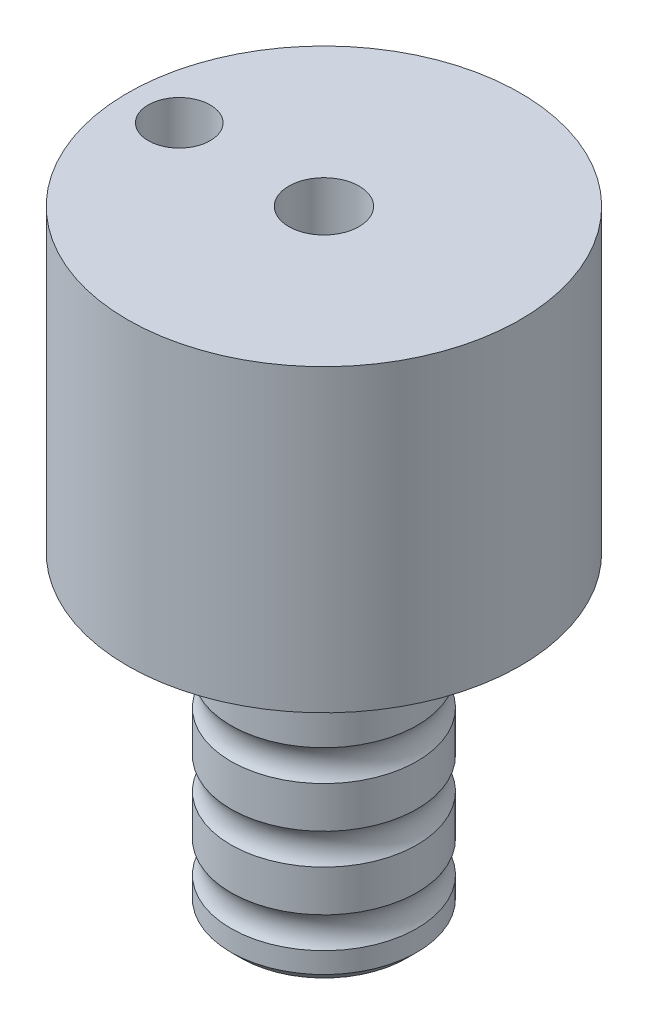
ISO-10303-21;
HEADER;
FILE_DESCRIPTION(('STEP AP214'),'2;1');
FILE_NAME('part.step','',(''),(''),'','','');
FILE_SCHEMA(('AUTOMOTIVE_DESIGN { 1 0 10303 214 1 1 1 1 }'));
ENDSEC;
DATA;
#1=APPLICATION_CONTEXT('core data for automotive mechanical design processes');
#2=APPLICATION_PROTOCOL_DEFINITION('international standard','automotive_design',2000,#1);
#3=PRODUCT_CONTEXT('',#1,'mechanical');
#4=PRODUCT('Part','Part','',(#3));
#5=PRODUCT_RELATED_PRODUCT_CATEGORY('part','',(#4));
#6=PRODUCT_DEFINITION_FORMATION('','',#4);
#7=PRODUCT_DEFINITION_CONTEXT('part definition',#1,'design');
#8=PRODUCT_DEFINITION('design','',#6,#7);
#9=PRODUCT_DEFINITION_SHAPE('','',#8);
#10=(LENGTH_UNIT() NAMED_UNIT(*) SI_UNIT(.MILLI.,.METRE.));
#11=(NAMED_UNIT(*) PLANE_ANGLE_UNIT() SI_UNIT($,.RADIAN.));
#12=(NAMED_UNIT(*) SI_UNIT($,.STERADIAN.) SOLID_ANGLE_UNIT());
#13=UNCERTAINTY_MEASURE_WITH_UNIT(LENGTH_MEASURE(1.E-05),#10,'distance_accuracy_value','');
#14=(GEOMETRIC_REPRESENTATION_CONTEXT(3) GLOBAL_UNCERTAINTY_ASSIGNED_CONTEXT((#13)) GLOBAL_UNIT_ASSIGNED_CONTEXT((#10,
#11,#12)) REPRESENTATION_CONTEXT('',''));
#15=CARTESIAN_POINT('',(0.,0.,0.));
#16=DIRECTION('',(0.,0.,1.));
#17=DIRECTION('',(1.,0.,0.));
#18=AXIS2_PLACEMENT_3D('',#15,#16,#17);
#19=CARTESIAN_POINT('',(0.,-59.,0.));
#20=DIRECTION('',(0.,1.,0.));
#21=DIRECTION('',(0.,0.,1.));
#22=AXIS2_PLACEMENT_3D('',#19,#20,#21);
#23=PLANE('',#22);
#24=CARTESIAN_POINT('',(0.,-59.,0.));
#25=DIRECTION('',(0.,1.,0.));
#26=DIRECTION('',(0.,0.,1.));
#27=AXIS2_PLACEMENT_3D('',#24,#25,#26);
#28=CIRCLE('',#27,8.);
#29=CARTESIAN_POINT('',(0.,-59.,8.));
#30=VERTEX_POINT('',#29);
#31=EDGE_CURVE('E11',#30,#30,#28,.T.);
#32=ORIENTED_EDGE('',*,*,#31,.F.);
#33=EDGE_LOOP('',(#32));
#34=FACE_BOUND('',#33,.T.);
#35=ADVANCED_FACE('F16',(#34),#23,.F.);
#36=CARTESIAN_POINT('',(0.,-59.,0.));
#37=DIRECTION('',(0.,1.,0.));
#38=DIRECTION('',(0.,0.,1.));
#39=AXIS2_PLACEMENT_3D('',#36,#37,#38);
#40=CONICAL_SURFACE('',#39,8.,0.785398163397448);
#41=CARTESIAN_POINT('',(0.,-58.,0.));
#42=DIRECTION('',(0.,1.,0.));
#43=DIRECTION('',(0.,0.,1.));
#44=AXIS2_PLACEMENT_3D('',#41,#42,#43);
#45=CIRCLE('',#44,9.);
#46=CARTESIAN_POINT('',(0.,-58.,9.));
#47=VERTEX_POINT('',#46);
#48=EDGE_CURVE('E23',#47,#47,#45,.T.);
#49=ORIENTED_EDGE('',*,*,#48,.F.);
#50=EDGE_LOOP('',(#49));
#51=FACE_BOUND('',#50,.T.);
#52=ORIENTED_EDGE('',*,*,#31,.T.);
#53=EDGE_LOOP('',(#52));
#54=FACE_BOUND('',#53,.T.);
#55=ADVANCED_FACE('F93',(#51,#54),#40,.T.);
#56=CARTESIAN_POINT('',(0.,47.548522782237,0.));
#57=DIRECTION('',(0.,1.,0.));
#58=DIRECTION('',(0.,0.,1.));
#59=AXIS2_PLACEMENT_3D('',#56,#57,#58);
#60=CYLINDRICAL_SURFACE('',#59,9.);
#61=CARTESIAN_POINT('',(0.,-56.,0.));
#62=DIRECTION('',(0.,1.,0.));
#63=DIRECTION('',(0.,0.,1.));
#64=AXIS2_PLACEMENT_3D('',#61,#62,#63);
#65=CIRCLE('',#64,9.);
#66=CARTESIAN_POINT('',(0.,-56.,9.));
#67=VERTEX_POINT('',#66);
#68=EDGE_CURVE('E86',#67,#67,#65,.T.);
#69=ORIENTED_EDGE('',*,*,#68,.F.);
#70=EDGE_LOOP('',(#69));
#71=FACE_BOUND('',#70,.T.);
#72=ORIENTED_EDGE('',*,*,#48,.T.);
#73=EDGE_LOOP('',(#72));
#74=FACE_BOUND('',#73,.T.);
#75=ADVANCED_FACE('F91',(#71,#74),#60,.T.);
#76=CARTESIAN_POINT('',(0.,-54.5,0.));
#77=DIRECTION('',(0.,1.,0.));
#78=DIRECTION('',(0.,0.,1.));
#79=AXIS2_PLACEMENT_3D('',#76,#77,#78);
#80=TOROIDAL_SURFACE('',#79,11.,2.5);
#81=CARTESIAN_POINT('',(0.,-53.,0.));
#82=DIRECTION('',(0.,1.,0.));
#83=DIRECTION('',(0.,0.,1.));
#84=AXIS2_PLACEMENT_3D('',#81,#82,#83);
#85=CIRCLE('',#84,9.);
#86=CARTESIAN_POINT('',(0.,-53.,9.));
#87=VERTEX_POINT('',#86);
#88=EDGE_CURVE('E83',#87,#87,#85,.T.);
#89=ORIENTED_EDGE('',*,*,#88,.F.);
#90=EDGE_LOOP('',(#89));
#91=FACE_BOUND('',#90,.T.);
#92=ORIENTED_EDGE('',*,*,#68,.T.);
#93=EDGE_LOOP('',(#92));
#94=FACE_BOUND('',#93,.T.);
#95=ADVANCED_FACE('F117',(#91,#94),#80,.F.);
#96=CARTESIAN_POINT('',(0.,47.548522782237,0.));
#97=DIRECTION('',(0.,1.,0.));
#98=DIRECTION('',(0.,0.,1.));
#99=AXIS2_PLACEMENT_3D('',#96,#97,#98);
#100=CYLINDRICAL_SURFACE('',#99,9.);
#101=CARTESIAN_POINT('',(0.,-49.,0.));
#102=DIRECTION('',(0.,1.,0.));
#103=DIRECTION('',(0.,0.,1.));
#104=AXIS2_PLACEMENT_3D('',#101,#102,#103);
#105=CIRCLE('',#104,9.);
#106=CARTESIAN_POINT('',(0.,-49.,9.));
#107=VERTEX_POINT('',#106);
#108=EDGE_CURVE('E80',#107,#107,#105,.T.);
#109=ORIENTED_EDGE('',*,*,#108,.F.);
#110=EDGE_LOOP('',(#109));
#111=FACE_BOUND('',#110,.T.);
#112=ORIENTED_EDGE('',*,*,#88,.T.);
#113=EDGE_LOOP('',(#112));
#114=FACE_BOUND('',#113,.T.);
#115=ADVANCED_FACE('F125',(#111,#114),#100,.T.);
#116=CARTESIAN_POINT('',(0.,-47.5,0.));
#117=DIRECTION('',(0.,1.,0.));
#118=DIRECTION('',(0.,0.,1.));
#119=AXIS2_PLACEMENT_3D('',#116,#117,#118);
#120=TOROIDAL_SURFACE('',#119,11.,2.5);
#121=CARTESIAN_POINT('',(0.,-46.,0.));
#122=DIRECTION('',(0.,1.,0.));
#123=DIRECTION('',(0.,0.,1.));
#124=AXIS2_PLACEMENT_3D('',#121,#122,#123);
#125=CIRCLE('',#124,9.);
#126=CARTESIAN_POINT('',(0.,-46.,9.));
#127=VERTEX_POINT('',#126);
#128=EDGE_CURVE('E77',#127,#127,#125,.T.);
#129=ORIENTED_EDGE('',*,*,#128,.F.);
#130=EDGE_LOOP('',(#129));
#131=FACE_BOUND('',#130,.T.);
#132=ORIENTED_EDGE('',*,*,#108,.T.);
#133=EDGE_LOOP('',(#132));
#134=FACE_BOUND('',#133,.T.);
#135=ADVANCED_FACE('F133',(#131,#134),#120,.F.);
#136=CARTESIAN_POINT('',(0.,47.548522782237,0.));
#137=DIRECTION('',(0.,1.,0.));
#138=DIRECTION('',(0.,0.,1.));
#139=AXIS2_PLACEMENT_3D('',#136,#137,#138);
#140=CYLINDRICAL_SURFACE('',#139,9.);
#141=CARTESIAN_POINT('',(0.,-42.,0.));
#142=DIRECTION('',(0.,1.,0.));
#143=DIRECTION('',(0.,0.,1.));
#144=AXIS2_PLACEMENT_3D('',#141,#142,#143);
#145=CIRCLE('',#144,9.);
#146=CARTESIAN_POINT('',(0.,-42.,9.));
#147=VERTEX_POINT('',#146);
#148=EDGE_CURVE('E74',#147,#147,#145,.T.);
#149=ORIENTED_EDGE('',*,*,#148,.F.);
#150=EDGE_LOOP('',(#149));
#151=FACE_BOUND('',#150,.T.);
#152=ORIENTED_EDGE('',*,*,#128,.T.);
#153=EDGE_LOOP('',(#152));
#154=FACE_BOUND('',#153,.T.);
#155=ADVANCED_FACE('F141',(#151,#154),#140,.T.);
#156=CARTESIAN_POINT('',(0.,-40.5,0.));
#157=DIRECTION('',(0.,1.,0.));
#158=DIRECTION('',(0.,0.,1.));
#159=AXIS2_PLACEMENT_3D('',#156,#157,#158);
#160=TOROIDAL_SURFACE('',#159,11.,2.5);
#161=CARTESIAN_POINT('',(0.,-39.,0.));
#162=DIRECTION('',(0.,1.,0.));
#163=DIRECTION('',(0.,0.,1.));
#164=AXIS2_PLACEMENT_3D('',#161,#162,#163);
#165=CIRCLE('',#164,9.);
#166=CARTESIAN_POINT('',(0.,-39.,9.));
#167=VERTEX_POINT('',#166);
#168=EDGE_CURVE('E71',#167,#167,#165,.T.);
#169=ORIENTED_EDGE('',*,*,#168,.F.);
#170=EDGE_LOOP('',(#169));
#171=FACE_BOUND('',#170,.T.);
#172=ORIENTED_EDGE('',*,*,#148,.T.);
#173=EDGE_LOOP('',(#172));
#174=FACE_BOUND('',#173,.T.);
#175=ADVANCED_FACE('F149',(#171,#174),#160,.F.);
#176=CARTESIAN_POINT('',(0.,47.548522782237,0.));
#177=DIRECTION('',(0.,1.,0.));
#178=DIRECTION('',(0.,0.,1.));
#179=AXIS2_PLACEMENT_3D('',#176,#177,#178);
#180=CYLINDRICAL_SURFACE('',#179,9.);
#181=CARTESIAN_POINT('',(0.,-35.,0.));
#182=DIRECTION('',(0.,1.,0.));
#183=DIRECTION('',(0.,0.,1.));
#184=AXIS2_PLACEMENT_3D('',#181,#182,#183);
#185=CIRCLE('',#184,9.);
#186=CARTESIAN_POINT('',(0.,-35.,9.));
#187=VERTEX_POINT('',#186);
#188=EDGE_CURVE('E68',#187,#187,#185,.T.);
#189=ORIENTED_EDGE('',*,*,#188,.F.);
#190=EDGE_LOOP('',(#189));
#191=FACE_BOUND('',#190,.T.);
#192=ORIENTED_EDGE('',*,*,#168,.T.);
#193=EDGE_LOOP('',(#192));
#194=FACE_BOUND('',#193,.T.);
#195=ADVANCED_FACE('F157',(#191,#194),#180,.T.);
#196=CARTESIAN_POINT('',(0.,-33.5,0.));
#197=DIRECTION('',(0.,1.,0.));
#198=DIRECTION('',(0.,0.,1.));
#199=AXIS2_PLACEMENT_3D('',#196,#197,#198);
#200=TOROIDAL_SURFACE('',#199,11.,2.5);
#201=CARTESIAN_POINT('',(0.,-32.,0.));
#202=DIRECTION('',(0.,1.,0.));
#203=DIRECTION('',(0.,0.,1.));
#204=AXIS2_PLACEMENT_3D('',#201,#202,#203);
#205=CIRCLE('',#204,9.);
#206=CARTESIAN_POINT('',(0.,-32.,9.));
#207=VERTEX_POINT('',#206);
#208=EDGE_CURVE('E65',#207,#207,#205,.T.);
#209=ORIENTED_EDGE('',*,*,#208,.F.);
#210=EDGE_LOOP('',(#209));
#211=FACE_BOUND('',#210,.T.);
#212=ORIENTED_EDGE('',*,*,#188,.T.);
#213=EDGE_LOOP('',(#212));
#214=FACE_BOUND('',#213,.T.);
#215=ADVANCED_FACE('F165',(#211,#214),#200,.F.);
#216=CARTESIAN_POINT('',(0.,47.548522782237,0.));
#217=DIRECTION('',(0.,1.,0.));
#218=DIRECTION('',(0.,0.,1.));
#219=AXIS2_PLACEMENT_3D('',#216,#217,#218);
#220=CYLINDRICAL_SURFACE('',#219,9.);
#221=CARTESIAN_POINT('',(0.,-31.,0.));
#222=DIRECTION('',(0.,1.,0.));
#223=DIRECTION('',(0.,0.,1.));
#224=AXIS2_PLACEMENT_3D('',#221,#222,#223);
#225=CIRCLE('',#224,9.);
#226=CARTESIAN_POINT('',(0.,-31.,9.));
#227=VERTEX_POINT('',#226);
#228=EDGE_CURVE('E62',#227,#227,#225,.T.);
#229=ORIENTED_EDGE('',*,*,#228,.F.);
#230=EDGE_LOOP('',(#229));
#231=FACE_BOUND('',#230,.T.);
#232=ORIENTED_EDGE('',*,*,#208,.T.);
#233=EDGE_LOOP('',(#232));
#234=FACE_BOUND('',#233,.T.);
#235=ADVANCED_FACE('F173',(#231,#234),#220,.T.);
#236=CARTESIAN_POINT('',(8.,-31.,0.));
#237=DIRECTION('',(0.,-1.,0.));
#238=DIRECTION('',(0.,0.,-1.));
#239=AXIS2_PLACEMENT_3D('',#236,#237,#238);
#240=PLANE('',#239);
#241=CARTESIAN_POINT('',(0.,-31.,0.));
#242=DIRECTION('',(0.,1.,0.));
#243=DIRECTION('',(0.,0.,1.));
#244=AXIS2_PLACEMENT_3D('',#241,#242,#243);
#245=CIRCLE('',#244,8.);
#246=CARTESIAN_POINT('',(0.,-31.,8.));
#247=VERTEX_POINT('',#246);
#248=EDGE_CURVE('E59',#247,#247,#245,.T.);
#249=ORIENTED_EDGE('',*,*,#248,.F.);
#250=EDGE_LOOP('',(#249));
#251=FACE_BOUND('',#250,.T.);
#252=ORIENTED_EDGE('',*,*,#228,.T.);
#253=EDGE_LOOP('',(#252));
#254=FACE_BOUND('',#253,.T.);
#255=ADVANCED_FACE('F181',(#251,#254),#240,.F.);
#256=CARTESIAN_POINT('',(0.,47.548522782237,0.));
#257=DIRECTION('',(0.,1.,0.));
#258=DIRECTION('',(0.,0.,1.));
#259=AXIS2_PLACEMENT_3D('',#256,#257,#258);
#260=CYLINDRICAL_SURFACE('',#259,8.);
#261=CARTESIAN_POINT('',(0.,-29.,0.));
#262=DIRECTION('',(0.,1.,0.));
#263=DIRECTION('',(0.,0.,1.));
#264=AXIS2_PLACEMENT_3D('',#261,#262,#263);
#265=CIRCLE('',#264,8.);
#266=CARTESIAN_POINT('',(0.,-29.,8.));
#267=VERTEX_POINT('',#266);
#268=EDGE_CURVE('E56',#267,#267,#265,.T.);
#269=ORIENTED_EDGE('',*,*,#268,.F.);
#270=EDGE_LOOP('',(#269));
#271=FACE_BOUND('',#270,.T.);
#272=ORIENTED_EDGE('',*,*,#248,.T.);
#273=EDGE_LOOP('',(#272));
#274=FACE_BOUND('',#273,.T.);
#275=ADVANCED_FACE('F189',(#271,#274),#260,.T.);
#276=CARTESIAN_POINT('',(8.,-29.,0.));
#277=DIRECTION('',(0.,1.,0.));
#278=DIRECTION('',(0.,0.,1.));
#279=AXIS2_PLACEMENT_3D('',#276,#277,#278);
#280=PLANE('',#279);
#281=CARTESIAN_POINT('',(0.,-29.,0.));
#282=DIRECTION('',(0.,1.,0.));
#283=DIRECTION('',(0.,0.,1.));
#284=AXIS2_PLACEMENT_3D('',#281,#282,#283);
#285=CIRCLE('',#284,19.);
#286=CARTESIAN_POINT('',(0.,-29.,19.));
#287=VERTEX_POINT('',#286);
#288=EDGE_CURVE('E53',#287,#287,#285,.T.);
#289=ORIENTED_EDGE('',*,*,#288,.F.);
#290=EDGE_LOOP('',(#289));
#291=FACE_BOUND('',#290,.T.);
#292=ORIENTED_EDGE('',*,*,#268,.T.);
#293=EDGE_LOOP('',(#292));
#294=FACE_BOUND('',#293,.T.);
#295=ADVANCED_FACE('F197',(#291,#294),#280,.F.);
#296=CARTESIAN_POINT('',(0.,47.548522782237,0.));
#297=DIRECTION('',(0.,1.,0.));
#298=DIRECTION('',(0.,0.,1.));
#299=AXIS2_PLACEMENT_3D('',#296,#297,#298);
#300=CYLINDRICAL_SURFACE('',#299,19.);
#301=CARTESIAN_POINT('',(0.,0.,0.));
#302=DIRECTION('',(0.,1.,0.));
#303=DIRECTION('',(0.,0.,1.));
#304=AXIS2_PLACEMENT_3D('',#301,#302,#303);
#305=CIRCLE('',#304,19.);
#306=CARTESIAN_POINT('',(0.,0.,19.));
#307=VERTEX_POINT('',#306);
#308=EDGE_CURVE('E50',#307,#307,#305,.T.);
#309=ORIENTED_EDGE('',*,*,#308,.F.);
#310=EDGE_LOOP('',(#309));
#311=FACE_BOUND('',#310,.T.);
#312=ORIENTED_EDGE('',*,*,#288,.T.);
#313=EDGE_LOOP('',(#312));
#314=FACE_BOUND('',#313,.T.);
#315=ADVANCED_FACE('F205',(#311,#314),#300,.T.);
#316=CARTESIAN_POINT('',(19.,0.,0.));
#317=DIRECTION('',(0.,-1.,0.));
#318=DIRECTION('',(0.,0.,-1.));
#319=AXIS2_PLACEMENT_3D('',#316,#317,#318);
#320=PLANE('',#319);
#321=CARTESIAN_POINT('',(-14.,0.,0.));
#322=DIRECTION('',(0.,1.,0.));
#323=DIRECTION('',(0.,0.,1.));
#324=AXIS2_PLACEMENT_3D('',#321,#322,#323);
#325=CIRCLE('',#324,3.);
#326=CARTESIAN_POINT('',(-14.,0.,3.));
#327=VERTEX_POINT('',#326);
#328=EDGE_CURVE('E40',#327,#327,#325,.T.);
#329=ORIENTED_EDGE('',*,*,#328,.F.);
#330=EDGE_LOOP('',(#329));
#331=FACE_BOUND('',#330,.T.);
#332=CARTESIAN_POINT('',(0.,0.,0.));
#333=DIRECTION('',(0.,1.,0.));
#334=DIRECTION('',(0.,0.,1.));
#335=AXIS2_PLACEMENT_3D('',#332,#333,#334);
#336=CIRCLE('',#335,3.4);
#337=CARTESIAN_POINT('',(0.,0.,3.4));
#338=VERTEX_POINT('',#337);
#339=EDGE_CURVE('E43',#338,#338,#336,.T.);
#340=ORIENTED_EDGE('',*,*,#339,.F.);
#341=EDGE_LOOP('',(#340));
#342=FACE_BOUND('',#341,.T.);
#343=ORIENTED_EDGE('',*,*,#308,.T.);
#344=EDGE_LOOP('',(#343));
#345=FACE_BOUND('',#344,.T.);
#346=ADVANCED_FACE('F213',(#331,#342,#345),#320,.F.);
#347=CARTESIAN_POINT('',(0.,0.,0.));
#348=DIRECTION('',(0.,1.,0.));
#349=DIRECTION('',(0.,0.,1.));
#350=AXIS2_PLACEMENT_3D('',#347,#348,#349);
#351=CYLINDRICAL_SURFACE('',#350,3.4);
#352=CARTESIAN_POINT('',(0.,-25.,0.));
#353=DIRECTION('',(0.,1.,0.));
#354=DIRECTION('',(0.,0.,1.));
#355=AXIS2_PLACEMENT_3D('',#352,#353,#354);
#356=CIRCLE('',#355,3.4);
#357=CARTESIAN_POINT('',(0.,-25.,3.4));
#358=VERTEX_POINT('',#357);
#359=EDGE_CURVE('E39',#358,#358,#356,.T.);
#360=ORIENTED_EDGE('',*,*,#359,.F.);
#361=EDGE_LOOP('',(#360));
#362=FACE_BOUND('',#361,.T.);
#363=ORIENTED_EDGE('',*,*,#339,.T.);
#364=EDGE_LOOP('',(#363));
#365=FACE_BOUND('',#364,.T.);
#366=ADVANCED_FACE('F222',(#362,#365),#351,.F.);
#367=CARTESIAN_POINT('',(0.,-25.,0.));
#368=DIRECTION('',(0.,1.,0.));
#369=DIRECTION('',(0.,0.,1.));
#370=AXIS2_PLACEMENT_3D('',#367,#368,#369);
#371=CONICAL_SURFACE('',#370,3.4,1.02974425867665);
#372=CARTESIAN_POINT('',(0.,-27.0429261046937,0.));
#373=VERTEX_POINT('',#372);
#374=VERTEX_LOOP('',#373);
#375=FACE_BOUND('',#374,.T.);
#376=ORIENTED_EDGE('',*,*,#359,.T.);
#377=EDGE_LOOP('',(#376));
#378=FACE_BOUND('',#377,.T.);
#379=ADVANCED_FACE('F33',(#375,#378),#371,.F.);
#380=CARTESIAN_POINT('',(-14.,-10.,0.));
#381=DIRECTION('',(0.,1.,0.));
#382=DIRECTION('',(0.,0.,1.));
#383=AXIS2_PLACEMENT_3D('',#380,#381,#382);
#384=CONICAL_SURFACE('',#383,3.,1.02974425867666);
#385=CARTESIAN_POINT('',(-14.,-11.8025818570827,0.));
#386=VERTEX_POINT('',#385);
#387=VERTEX_LOOP('',#386);
#388=FACE_BOUND('',#387,.T.);
#389=CARTESIAN_POINT('',(-14.,-10.,0.));
#390=DIRECTION('',(0.,1.,0.));
#391=DIRECTION('',(0.,0.,1.));
#392=AXIS2_PLACEMENT_3D('',#389,#390,#391);
#393=CIRCLE('',#392,3.);
#394=CARTESIAN_POINT('',(-14.,-10.,3.));
#395=VERTEX_POINT('',#394);
#396=EDGE_CURVE('E37',#395,#395,#393,.T.);
#397=ORIENTED_EDGE('',*,*,#396,.T.);
#398=EDGE_LOOP('',(#397));
#399=FACE_BOUND('',#398,.T.);
#400=ADVANCED_FACE('F29',(#388,#399),#384,.F.);
#401=CARTESIAN_POINT('',(-14.,0.,0.));
#402=DIRECTION('',(0.,1.,0.));
#403=DIRECTION('',(0.,0.,1.));
#404=AXIS2_PLACEMENT_3D('',#401,#402,#403);
#405=CYLINDRICAL_SURFACE('',#404,3.);
#406=ORIENTED_EDGE('',*,*,#396,.F.);
#407=EDGE_LOOP('',(#406));
#408=FACE_BOUND('',#407,.T.);
#409=ORIENTED_EDGE('',*,*,#328,.T.);
#410=EDGE_LOOP('',(#409));
#411=FACE_BOUND('',#410,.T.);
#412=ADVANCED_FACE('F32',(#408,#411),#405,.F.);
#413=CLOSED_SHELL('',(#35,#55,#75,#95,#115,#135,#155,#175,#195,#215,#235,#255,#275,#295,#315,
#346,#366,#379,#400,#412));
#414=MANIFOLD_SOLID_BREP('B1',#413);
#415=ADVANCED_BREP_SHAPE_REPRESENTATION('',(#18,#414),#14);
#416=SHAPE_DEFINITION_REPRESENTATION(#9,#415);
ENDSEC;
END-ISO-10303-21;
